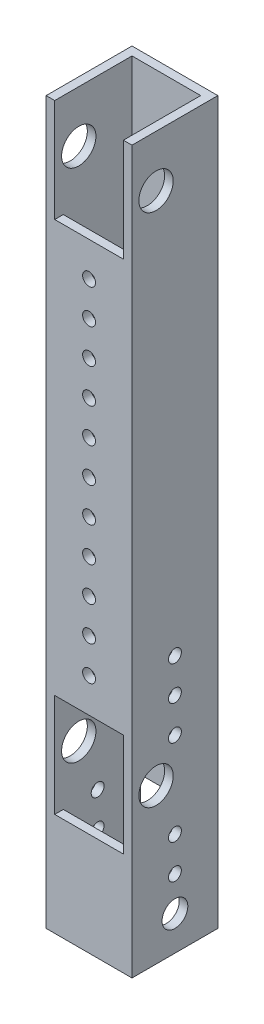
from build123d import *

# Parameters (mm, degrees)
SKETCH1_W           = 31.75
SKETCH1_H           = 31.75
SKETCH1_W_2         = 25.4
SKETCH1_H_2         = 25.4
BOSS_EXTRUDE1_DEPTH = 266.7
SKETCH3_R           = 6.35
SKETCH3_R_2         = 4.7625
SKETCH3_R_3         = 2.38125
CUT_EXTRUDE1_DEPTH  = 270.05198034
CUT_EXTRUDE2_REACH  = 271.052
SKETCH4_W           = 25.4
SKETCH4_H           = 38.1
CUT_EXTRUDE3_REACH  = 271.052
SKETCH5_W           = 25.4
SKETCH5_H           = 38.1
SKETCH5_R           = 2.38125
CUT_EXTRUDE4_REACH  = 271.052


with BuildPart() as part:
    # Sketch1 → Boss-Extrude1 (new body)
    with BuildSketch(Plane(origin=(0, 0, 0), x_dir=(1, 0, 0), z_dir=(0, 1, 0))):
        Rectangle(SKETCH1_W, SKETCH1_H)
        Rectangle(SKETCH1_W_2, SKETCH1_H_2, mode=Mode.SUBTRACT)
    extrude(amount=BOSS_EXTRUDE1_DEPTH)

    # Sketch3 → Cut-Extrude1 (cut, through all)
    with BuildSketch(Plane(origin=(15.875, 0, 0), x_dir=(0, 0, -1), z_dir=(1, 0, 0))):
        with Locations((-6.985, 247.65)):
            Circle(SKETCH3_R)
        with Locations((-6.985, 57.15)):
            Circle(SKETCH3_R)
        with Locations((0, 12.7)):
            Circle(SKETCH3_R_2)
        with Locations((0, 25.4)):
            Circle(SKETCH3_R_3)
        with Locations((0, 38.1)):
            Circle(SKETCH3_R_3)
        with Locations((0, 69.85)):
            Circle(SKETCH3_R_3)
        with Locations((0, 82.55)):
            Circle(SKETCH3_R_3)
        with Locations((0, 95.25)):
            Circle(SKETCH3_R_3)
    extrude(amount=-CUT_EXTRUDE1_DEPTH, mode=Mode.SUBTRACT)

    # Sketch4 → Cut-Extrude2 (cut, up to next)
    with BuildSketch(Plane(origin=(0, 0, -15.875), x_dir=(-1, 0, 0), z_dir=(0, 0, -1)), mode=Mode.PRIVATE) as cut_extrude2_sk1:
        with Locations((0, 19.05)):
            Rectangle(SKETCH4_W, SKETCH4_H)
    cut_extrude2_tool1 = extrude(cut_extrude2_sk1.sketch, amount=-CUT_EXTRUDE2_REACH, mode=Mode.PRIVATE) & part.part
    add(cut_extrude2_tool1.solids().sort_by_distance((0, 19.05, -15.875))[0], mode=Mode.SUBTRACT)

    # Sketch5 → Cut-Extrude3 (cut, up to next)
    with BuildSketch(Plane.XY.offset(15.875), mode=Mode.PRIVATE) as cut_extrude3_sk1:
        with Locations((0, 57.15)):
            Rectangle(SKETCH5_W, SKETCH5_H)
    cut_extrude3_tool1 = extrude(cut_extrude3_sk1.sketch, amount=-CUT_EXTRUDE3_REACH, mode=Mode.PRIVATE) & part.part
    # Sketch5 → Cut-Extrude3 (cut, up to next)
    with BuildSketch(Plane.XY.offset(15.875), mode=Mode.PRIVATE) as cut_extrude3_sk2:
        with Locations((0, 247.65)):
            Rectangle(SKETCH5_W, SKETCH5_H)
    cut_extrude3_tool2 = extrude(cut_extrude3_sk2.sketch, amount=-CUT_EXTRUDE3_REACH, mode=Mode.PRIVATE) & part.part
    # Sketch5 → Cut-Extrude3 (cut, up to next)
    with BuildSketch(Plane.XY.offset(15.875), mode=Mode.PRIVATE) as cut_extrude3_sk3:
        with Locations((0, 215.9)):
            Circle(SKETCH5_R)
    cut_extrude3_tool3 = extrude(cut_extrude3_sk3.sketch, amount=-CUT_EXTRUDE3_REACH, mode=Mode.PRIVATE) & part.part
    # Sketch5 → Cut-Extrude3 (cut, up to next)
    with BuildSketch(Plane.XY.offset(15.875), mode=Mode.PRIVATE) as cut_extrude3_sk4:
        with Locations((0, 203.2)):
            Circle(SKETCH5_R)
    cut_extrude3_tool4 = extrude(cut_extrude3_sk4.sketch, amount=-CUT_EXTRUDE3_REACH, mode=Mode.PRIVATE) & part.part
    # Sketch5 → Cut-Extrude3 (cut, up to next)
    with BuildSketch(Plane.XY.offset(15.875), mode=Mode.PRIVATE) as cut_extrude3_sk5:
        with Locations((0, 190.5)):
            Circle(SKETCH5_R)
    cut_extrude3_tool5 = extrude(cut_extrude3_sk5.sketch, amount=-CUT_EXTRUDE3_REACH, mode=Mode.PRIVATE) & part.part
    # Sketch5 → Cut-Extrude3 (cut, up to next)
    with BuildSketch(Plane.XY.offset(15.875), mode=Mode.PRIVATE) as cut_extrude3_sk6:
        with Locations((0, 177.8)):
            Circle(SKETCH5_R)
    cut_extrude3_tool6 = extrude(cut_extrude3_sk6.sketch, amount=-CUT_EXTRUDE3_REACH, mode=Mode.PRIVATE) & part.part
    # Sketch5 → Cut-Extrude3 (cut, up to next)
    with BuildSketch(Plane.XY.offset(15.875), mode=Mode.PRIVATE) as cut_extrude3_sk7:
        with Locations((0, 165.1)):
            Circle(SKETCH5_R)
    cut_extrude3_tool7 = extrude(cut_extrude3_sk7.sketch, amount=-CUT_EXTRUDE3_REACH, mode=Mode.PRIVATE) & part.part
    # Sketch5 → Cut-Extrude3 (cut, up to next)
    with BuildSketch(Plane.XY.offset(15.875), mode=Mode.PRIVATE) as cut_extrude3_sk8:
        with Locations((0, 88.9)):
            Circle(SKETCH5_R)
    cut_extrude3_tool8 = extrude(cut_extrude3_sk8.sketch, amount=-CUT_EXTRUDE3_REACH, mode=Mode.PRIVATE) & part.part
    # Sketch5 → Cut-Extrude3 (cut, up to next)
    with BuildSketch(Plane.XY.offset(15.875), mode=Mode.PRIVATE) as cut_extrude3_sk9:
        with Locations((0, 101.6)):
            Circle(SKETCH5_R)
    cut_extrude3_tool9 = extrude(cut_extrude3_sk9.sketch, amount=-CUT_EXTRUDE3_REACH, mode=Mode.PRIVATE) & part.part
    # Sketch5 → Cut-Extrude3 (cut, up to next)
    with BuildSketch(Plane.XY.offset(15.875), mode=Mode.PRIVATE) as cut_extrude3_sk10:
        with Locations((0, 114.3)):
            Circle(SKETCH5_R)
    cut_extrude3_tool10 = extrude(cut_extrude3_sk10.sketch, amount=-CUT_EXTRUDE3_REACH, mode=Mode.PRIVATE) & part.part
    # Sketch5 → Cut-Extrude3 (cut, up to next)
    with BuildSketch(Plane.XY.offset(15.875), mode=Mode.PRIVATE) as cut_extrude3_sk11:
        with Locations((0, 127)):
            Circle(SKETCH5_R)
    cut_extrude3_tool11 = extrude(cut_extrude3_sk11.sketch, amount=-CUT_EXTRUDE3_REACH, mode=Mode.PRIVATE) & part.part
    # Sketch5 → Cut-Extrude3 (cut, up to next)
    with BuildSketch(Plane.XY.offset(15.875), mode=Mode.PRIVATE) as cut_extrude3_sk12:
        with Locations((0, 139.7)):
            Circle(SKETCH5_R)
    cut_extrude3_tool12 = extrude(cut_extrude3_sk12.sketch, amount=-CUT_EXTRUDE3_REACH, mode=Mode.PRIVATE) & part.part
    # Sketch5 → Cut-Extrude3 (cut, up to next)
    with BuildSketch(Plane.XY.offset(15.875), mode=Mode.PRIVATE) as cut_extrude3_sk13:
        with Locations((0, 152.4)):
            Circle(SKETCH5_R)
    cut_extrude3_tool13 = extrude(cut_extrude3_sk13.sketch, amount=-CUT_EXTRUDE3_REACH, mode=Mode.PRIVATE) & part.part
    add(cut_extrude3_tool1.solids().sort_by_distance((0, 57.15, 15.875))[0], mode=Mode.SUBTRACT)
    add(cut_extrude3_tool2.solids().sort_by_distance((0, 247.65, 15.875))[0], mode=Mode.SUBTRACT)
    add(cut_extrude3_tool3.solids().sort_by_distance((0, 215.9, 15.875))[0], mode=Mode.SUBTRACT)
    add(cut_extrude3_tool4.solids().sort_by_distance((0, 203.2, 15.875))[0], mode=Mode.SUBTRACT)
    add(cut_extrude3_tool5.solids().sort_by_distance((0, 190.5, 15.875))[0], mode=Mode.SUBTRACT)
    add(cut_extrude3_tool6.solids().sort_by_distance((0, 177.8, 15.875))[0], mode=Mode.SUBTRACT)
    add(cut_extrude3_tool7.solids().sort_by_distance((0, 165.1, 15.875))[0], mode=Mode.SUBTRACT)
    add(cut_extrude3_tool8.solids().sort_by_distance((0, 88.9, 15.875))[0], mode=Mode.SUBTRACT)
    add(cut_extrude3_tool9.solids().sort_by_distance((0, 101.6, 15.875))[0], mode=Mode.SUBTRACT)
    add(cut_extrude3_tool10.solids().sort_by_distance((0, 114.3, 15.875))[0], mode=Mode.SUBTRACT)
    add(cut_extrude3_tool11.solids().sort_by_distance((0, 127, 15.875))[0], mode=Mode.SUBTRACT)
    add(cut_extrude3_tool12.solids().sort_by_distance((0, 139.7, 15.875))[0], mode=Mode.SUBTRACT)
    add(cut_extrude3_tool13.solids().sort_by_distance((0, 152.4, 15.875))[0], mode=Mode.SUBTRACT)

    # Sketch6 → Cut-Extrude4 (cut, up to next)
    with BuildSketch(Plane(origin=(0, 0, -15.875), x_dir=(-1, 0, 0), z_dir=(0, 0, -1)), mode=Mode.PRIVATE) as cut_extrude4_sk1:
        with BuildLine():
            Line((-8.5725, 88.9), (-8.5725, 215.9))
            ThreePointArc((-8.5725, 215.9), (0, 224.4725), (8.5725, 215.9))
            Line((8.5725, 215.9), (8.5725, 88.9))
            ThreePointArc((8.5725, 88.9), (0, 80.3275), (-8.5725, 88.9))
        make_face()
    cut_extrude4_tool1 = extrude(cut_extrude4_sk1.sketch, amount=-CUT_EXTRUDE4_REACH, mode=Mode.PRIVATE) & part.part
    add(cut_extrude4_tool1.solids().sort_by_distance((0, 152.4, -15.875))[0], mode=Mode.SUBTRACT)


solid = part.part
